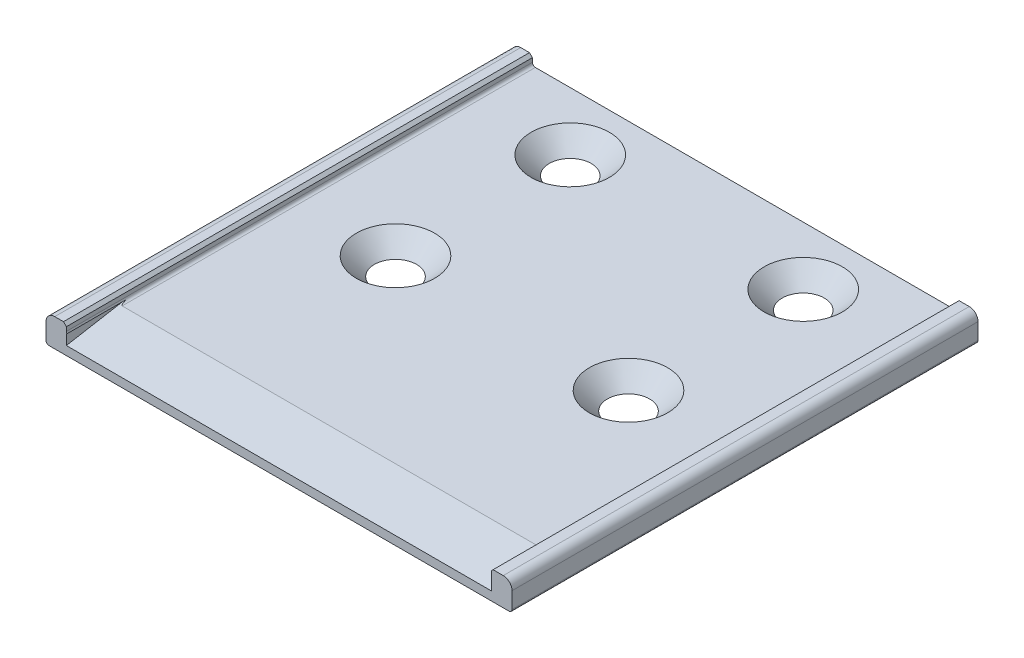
ISO-10303-21;
HEADER;
FILE_DESCRIPTION(('STEP AP214'),'2;1');
FILE_NAME('part.step','',(''),(''),'','','');
FILE_SCHEMA(('AUTOMOTIVE_DESIGN { 1 0 10303 214 1 1 1 1 }'));
ENDSEC;
DATA;
#1=APPLICATION_CONTEXT('core data for automotive mechanical design processes');
#2=APPLICATION_PROTOCOL_DEFINITION('international standard','automotive_design',2000,#1);
#3=PRODUCT_CONTEXT('',#1,'mechanical');
#4=PRODUCT('Part','Part','',(#3));
#5=PRODUCT_RELATED_PRODUCT_CATEGORY('part','',(#4));
#6=PRODUCT_DEFINITION_FORMATION('','',#4);
#7=PRODUCT_DEFINITION_CONTEXT('part definition',#1,'design');
#8=PRODUCT_DEFINITION('design','',#6,#7);
#9=PRODUCT_DEFINITION_SHAPE('','',#8);
#10=(LENGTH_UNIT() NAMED_UNIT(*) SI_UNIT(.MILLI.,.METRE.));
#11=(NAMED_UNIT(*) PLANE_ANGLE_UNIT() SI_UNIT($,.RADIAN.));
#12=(NAMED_UNIT(*) SI_UNIT($,.STERADIAN.) SOLID_ANGLE_UNIT());
#13=UNCERTAINTY_MEASURE_WITH_UNIT(LENGTH_MEASURE(1.E-05),#10,'distance_accuracy_value','');
#14=(GEOMETRIC_REPRESENTATION_CONTEXT(3) GLOBAL_UNCERTAINTY_ASSIGNED_CONTEXT((#13)) GLOBAL_UNIT_ASSIGNED_CONTEXT((#10,
#11,#12)) REPRESENTATION_CONTEXT('',''));
#15=CARTESIAN_POINT('',(0.,0.,0.));
#16=DIRECTION('',(0.,0.,1.));
#17=DIRECTION('',(1.,0.,0.));
#18=AXIS2_PLACEMENT_3D('',#15,#16,#17);
#19=CARTESIAN_POINT('',(79.5,0.5,-80.));
#20=DIRECTION('',(0.,0.,1.));
#21=DIRECTION('',(1.,0.,0.));
#22=AXIS2_PLACEMENT_3D('',#19,#20,#21);
#23=CYLINDRICAL_SURFACE('',#22,0.5);
#24=CARTESIAN_POINT('',(79.5,0.5,0.));
#25=DIRECTION('',(0.,0.,1.));
#26=DIRECTION('',(1.,0.,0.));
#27=AXIS2_PLACEMENT_3D('',#24,#25,#26);
#28=CIRCLE('',#27,0.5);
#29=CARTESIAN_POINT('',(79.5,0.,0.));
#30=VERTEX_POINT('',#29);
#31=CARTESIAN_POINT('',(80.,0.5,0.));
#32=VERTEX_POINT('',#31);
#33=EDGE_CURVE('E195',#30,#32,#28,.T.);
#34=ORIENTED_EDGE('',*,*,#33,.F.);
#35=DIRECTION('',(0.,0.,1.));
#36=VECTOR('',#35,1.);
#37=CARTESIAN_POINT('',(79.5,0.,-80.));
#38=LINE('',#37,#36);
#39=CARTESIAN_POINT('',(79.5,0.,-80.));
#40=VERTEX_POINT('',#39);
#41=EDGE_CURVE('E65',#40,#30,#38,.T.);
#42=ORIENTED_EDGE('',*,*,#41,.F.);
#43=CARTESIAN_POINT('',(79.5,0.5,-80.));
#44=DIRECTION('',(0.,0.,1.));
#45=DIRECTION('',(1.,0.,0.));
#46=AXIS2_PLACEMENT_3D('',#43,#44,#45);
#47=CIRCLE('',#46,0.5);
#48=CARTESIAN_POINT('',(80.,0.5,-80.));
#49=VERTEX_POINT('',#48);
#50=EDGE_CURVE('E237',#40,#49,#47,.T.);
#51=ORIENTED_EDGE('',*,*,#50,.T.);
#52=DIRECTION('',(0.,0.,1.));
#53=VECTOR('',#52,1.);
#54=CARTESIAN_POINT('',(80.,0.5,-80.));
#55=LINE('',#54,#53);
#56=EDGE_CURVE('E122',#49,#32,#55,.T.);
#57=ORIENTED_EDGE('',*,*,#56,.T.);
#58=EDGE_LOOP('',(#34,#42,#51,#57));
#59=FACE_BOUND('',#58,.T.);
#60=ADVANCED_FACE('F41',(#59),#23,.T.);
#61=CARTESIAN_POINT('',(0.500000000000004,0.,-80.));
#62=DIRECTION('',(0.,-1.,0.));
#63=DIRECTION('',(0.,0.,-1.));
#64=AXIS2_PLACEMENT_3D('',#61,#62,#63);
#65=PLANE('',#64);
#66=CARTESIAN_POINT('',(20.,0.,-40.));
#67=DIRECTION('',(0.,-1.,0.));
#68=DIRECTION('',(0.,0.,-1.));
#69=AXIS2_PLACEMENT_3D('',#66,#67,#68);
#70=CIRCLE('',#69,3.61999999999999);
#71=CARTESIAN_POINT('',(20.,0.,-43.62));
#72=VERTEX_POINT('',#71);
#73=EDGE_CURVE('E326',#72,#72,#70,.T.);
#74=ORIENTED_EDGE('',*,*,#73,.F.);
#75=EDGE_LOOP('',(#74));
#76=FACE_BOUND('',#75,.T.);
#77=CARTESIAN_POINT('',(20.,0.,-70.));
#78=DIRECTION('',(0.,-1.,0.));
#79=DIRECTION('',(0.,0.,-1.));
#80=AXIS2_PLACEMENT_3D('',#77,#78,#79);
#81=CIRCLE('',#80,3.61999999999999);
#82=CARTESIAN_POINT('',(20.,0.,-73.62));
#83=VERTEX_POINT('',#82);
#84=EDGE_CURVE('E332',#83,#83,#81,.T.);
#85=ORIENTED_EDGE('',*,*,#84,.F.);
#86=EDGE_LOOP('',(#85));
#87=FACE_BOUND('',#86,.T.);
#88=CARTESIAN_POINT('',(60.,0.,-40.));
#89=DIRECTION('',(0.,-1.,0.));
#90=DIRECTION('',(0.,0.,-1.));
#91=AXIS2_PLACEMENT_3D('',#88,#89,#90);
#92=CIRCLE('',#91,3.61999999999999);
#93=CARTESIAN_POINT('',(60.,0.,-43.62));
#94=VERTEX_POINT('',#93);
#95=EDGE_CURVE('E338',#94,#94,#92,.T.);
#96=ORIENTED_EDGE('',*,*,#95,.F.);
#97=EDGE_LOOP('',(#96));
#98=FACE_BOUND('',#97,.T.);
#99=CARTESIAN_POINT('',(60.,0.,-70.));
#100=DIRECTION('',(0.,-1.,0.));
#101=DIRECTION('',(0.,0.,-1.));
#102=AXIS2_PLACEMENT_3D('',#99,#100,#101);
#103=CIRCLE('',#102,3.61999999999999);
#104=CARTESIAN_POINT('',(60.,0.,-73.62));
#105=VERTEX_POINT('',#104);
#106=EDGE_CURVE('E199',#105,#105,#103,.T.);
#107=ORIENTED_EDGE('',*,*,#106,.F.);
#108=EDGE_LOOP('',(#107));
#109=FACE_BOUND('',#108,.T.);
#110=DIRECTION('',(1.,0.,0.));
#111=VECTOR('',#110,1.);
#112=CARTESIAN_POINT('',(0.500000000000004,0.,0.));
#113=LINE('',#112,#111);
#114=CARTESIAN_POINT('',(0.500000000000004,0.,0.));
#115=VERTEX_POINT('',#114);
#116=EDGE_CURVE('E234',#115,#30,#113,.T.);
#117=ORIENTED_EDGE('',*,*,#116,.F.);
#118=DIRECTION('',(0.,0.,1.));
#119=VECTOR('',#118,1.);
#120=CARTESIAN_POINT('',(0.500000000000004,0.,-80.));
#121=LINE('',#120,#119);
#122=CARTESIAN_POINT('',(0.500000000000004,0.,-80.));
#123=VERTEX_POINT('',#122);
#124=EDGE_CURVE('E176',#123,#115,#121,.T.);
#125=ORIENTED_EDGE('',*,*,#124,.F.);
#126=DIRECTION('',(1.,0.,0.));
#127=VECTOR('',#126,1.);
#128=CARTESIAN_POINT('',(0.500000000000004,0.,-80.));
#129=LINE('',#128,#127);
#130=EDGE_CURVE('E185',#123,#40,#129,.T.);
#131=ORIENTED_EDGE('',*,*,#130,.T.);
#132=ORIENTED_EDGE('',*,*,#41,.T.);
#133=EDGE_LOOP('',(#117,#125,#131,#132));
#134=FACE_BOUND('',#133,.T.);
#135=ADVANCED_FACE('F427',(#76,#87,#98,#109,#134),#65,.T.);
#136=CARTESIAN_POINT('',(0.5,0.5,-80.));
#137=DIRECTION('',(0.,0.,1.));
#138=DIRECTION('',(1.,0.,0.));
#139=AXIS2_PLACEMENT_3D('',#136,#137,#138);
#140=CYLINDRICAL_SURFACE('',#139,0.5);
#141=CARTESIAN_POINT('',(0.5,0.5,0.));
#142=DIRECTION('',(0.,0.,1.));
#143=DIRECTION('',(1.,0.,0.));
#144=AXIS2_PLACEMENT_3D('',#141,#142,#143);
#145=CIRCLE('',#144,0.5);
#146=CARTESIAN_POINT('',(0.,0.500000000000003,0.));
#147=VERTEX_POINT('',#146);
#148=EDGE_CURVE('E171',#147,#115,#145,.T.);
#149=ORIENTED_EDGE('',*,*,#148,.F.);
#150=DIRECTION('',(0.,0.,1.));
#151=VECTOR('',#150,1.);
#152=CARTESIAN_POINT('',(0.,0.500000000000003,-80.));
#153=LINE('',#152,#151);
#154=CARTESIAN_POINT('',(0.,0.500000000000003,-80.));
#155=VERTEX_POINT('',#154);
#156=EDGE_CURVE('E165',#155,#147,#153,.T.);
#157=ORIENTED_EDGE('',*,*,#156,.F.);
#158=CARTESIAN_POINT('',(0.5,0.5,-80.));
#159=DIRECTION('',(0.,0.,1.));
#160=DIRECTION('',(1.,0.,0.));
#161=AXIS2_PLACEMENT_3D('',#158,#159,#160);
#162=CIRCLE('',#161,0.5);
#163=EDGE_CURVE('E168',#155,#123,#162,.T.);
#164=ORIENTED_EDGE('',*,*,#163,.T.);
#165=ORIENTED_EDGE('',*,*,#124,.T.);
#166=EDGE_LOOP('',(#149,#157,#164,#165));
#167=FACE_BOUND('',#166,.T.);
#168=ADVANCED_FACE('F167',(#167),#140,.T.);
#169=CARTESIAN_POINT('',(0.,0.500000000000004,-80.));
#170=DIRECTION('',(-1.,0.,0.));
#171=DIRECTION('',(0.,0.,1.));
#172=AXIS2_PLACEMENT_3D('',#169,#170,#171);
#173=PLANE('',#172);
#174=DIRECTION('',(0.,-1.,0.));
#175=VECTOR('',#174,1.);
#176=CARTESIAN_POINT('',(0.,0.500000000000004,0.));
#177=LINE('',#176,#175);
#178=CARTESIAN_POINT('',(0.,3.3,0.));
#179=VERTEX_POINT('',#178);
#180=EDGE_CURVE('E231',#179,#147,#177,.T.);
#181=ORIENTED_EDGE('',*,*,#180,.F.);
#182=DIRECTION('',(0.,0.,1.));
#183=VECTOR('',#182,1.);
#184=CARTESIAN_POINT('',(0.,3.3,-80.));
#185=LINE('',#184,#183);
#186=CARTESIAN_POINT('',(0.,3.3,-80.));
#187=VERTEX_POINT('',#186);
#188=EDGE_CURVE('E177',#187,#179,#185,.T.);
#189=ORIENTED_EDGE('',*,*,#188,.F.);
#190=DIRECTION('',(0.,-1.,0.));
#191=VECTOR('',#190,1.);
#192=CARTESIAN_POINT('',(0.,0.500000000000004,-80.));
#193=LINE('',#192,#191);
#194=EDGE_CURVE('E183',#187,#155,#193,.T.);
#195=ORIENTED_EDGE('',*,*,#194,.T.);
#196=ORIENTED_EDGE('',*,*,#156,.T.);
#197=EDGE_LOOP('',(#181,#189,#195,#196));
#198=FACE_BOUND('',#197,.T.);
#199=ADVANCED_FACE('F187',(#198),#173,.T.);
#200=CARTESIAN_POINT('',(1.5,3.3,-80.));
#201=DIRECTION('',(0.,0.,1.));
#202=DIRECTION('',(1.,0.,0.));
#203=AXIS2_PLACEMENT_3D('',#200,#201,#202);
#204=CYLINDRICAL_SURFACE('',#203,1.5);
#205=CARTESIAN_POINT('',(1.5,3.3,0.));
#206=DIRECTION('',(0.,0.,1.));
#207=DIRECTION('',(-1.,0.,0.));
#208=AXIS2_PLACEMENT_3D('',#205,#206,#207);
#209=CIRCLE('',#208,1.5);
#210=CARTESIAN_POINT('',(1.5,4.8,0.));
#211=VERTEX_POINT('',#210);
#212=EDGE_CURVE('E228',#211,#179,#209,.T.);
#213=ORIENTED_EDGE('',*,*,#212,.F.);
#214=DIRECTION('',(0.,0.,1.));
#215=VECTOR('',#214,1.);
#216=CARTESIAN_POINT('',(1.5,4.8,-80.));
#217=LINE('',#216,#215);
#218=CARTESIAN_POINT('',(1.5,4.8,-80.));
#219=VERTEX_POINT('',#218);
#220=EDGE_CURVE('E242',#219,#211,#217,.T.);
#221=ORIENTED_EDGE('',*,*,#220,.F.);
#222=CARTESIAN_POINT('',(1.5,3.3,-80.));
#223=DIRECTION('',(0.,0.,1.));
#224=DIRECTION('',(-1.,0.,0.));
#225=AXIS2_PLACEMENT_3D('',#222,#223,#224);
#226=CIRCLE('',#225,1.5);
#227=EDGE_CURVE('E188',#219,#187,#226,.T.);
#228=ORIENTED_EDGE('',*,*,#227,.T.);
#229=ORIENTED_EDGE('',*,*,#188,.T.);
#230=EDGE_LOOP('',(#213,#221,#228,#229));
#231=FACE_BOUND('',#230,.T.);
#232=ADVANCED_FACE('F435',(#231),#204,.T.);
#233=CARTESIAN_POINT('',(1.5,4.8,-80.));
#234=DIRECTION('',(0.,1.,0.));
#235=DIRECTION('',(-1.,0.,0.));
#236=AXIS2_PLACEMENT_3D('',#233,#234,#235);
#237=PLANE('',#236);
#238=DIRECTION('',(-1.,0.,0.));
#239=VECTOR('',#238,1.);
#240=CARTESIAN_POINT('',(1.5,4.8,0.));
#241=LINE('',#240,#239);
#242=CARTESIAN_POINT('',(3.,4.8,0.));
#243=VERTEX_POINT('',#242);
#244=EDGE_CURVE('E225',#243,#211,#241,.T.);
#245=ORIENTED_EDGE('',*,*,#244,.F.);
#246=DIRECTION('',(0.,0.,1.));
#247=VECTOR('',#246,1.);
#248=CARTESIAN_POINT('',(3.,4.8,-80.));
#249=LINE('',#248,#247);
#250=CARTESIAN_POINT('',(3.,4.8,-80.));
#251=VERTEX_POINT('',#250);
#252=EDGE_CURVE('E244',#251,#243,#249,.T.);
#253=ORIENTED_EDGE('',*,*,#252,.F.);
#254=DIRECTION('',(-1.,0.,0.));
#255=VECTOR('',#254,1.);
#256=CARTESIAN_POINT('',(1.5,4.8,-80.));
#257=LINE('',#256,#255);
#258=EDGE_CURVE('E190',#251,#219,#257,.T.);
#259=ORIENTED_EDGE('',*,*,#258,.T.);
#260=ORIENTED_EDGE('',*,*,#220,.T.);
#261=EDGE_LOOP('',(#245,#253,#259,#260));
#262=FACE_BOUND('',#261,.T.);
#263=ADVANCED_FACE('F379',(#262),#237,.T.);
#264=CARTESIAN_POINT('',(3.,4.8,-80.));
#265=DIRECTION('',(0.707106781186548,0.707106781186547,0.));
#266=DIRECTION('',(-0.707106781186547,0.707106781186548,0.));
#267=AXIS2_PLACEMENT_3D('',#264,#265,#266);
#268=PLANE('',#267);
#269=DIRECTION('',(-0.707106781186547,0.707106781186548,0.));
#270=VECTOR('',#269,1.);
#271=CARTESIAN_POINT('',(3.,4.8,0.));
#272=LINE('',#271,#270);
#273=CARTESIAN_POINT('',(3.5,4.3,0.));
#274=VERTEX_POINT('',#273);
#275=EDGE_CURVE('E222',#274,#243,#272,.T.);
#276=ORIENTED_EDGE('',*,*,#275,.F.);
#277=DIRECTION('',(0.,0.,1.));
#278=VECTOR('',#277,1.);
#279=CARTESIAN_POINT('',(3.5,4.3,-80.));
#280=LINE('',#279,#278);
#281=CARTESIAN_POINT('',(3.5,4.3,-80.));
#282=VERTEX_POINT('',#281);
#283=EDGE_CURVE('E246',#282,#274,#280,.T.);
#284=ORIENTED_EDGE('',*,*,#283,.F.);
#285=DIRECTION('',(-0.707106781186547,0.707106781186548,0.));
#286=VECTOR('',#285,1.);
#287=CARTESIAN_POINT('',(3.,4.8,-80.));
#288=LINE('',#287,#286);
#289=EDGE_CURVE('E373',#282,#251,#288,.T.);
#290=ORIENTED_EDGE('',*,*,#289,.T.);
#291=ORIENTED_EDGE('',*,*,#252,.T.);
#292=EDGE_LOOP('',(#276,#284,#290,#291));
#293=FACE_BOUND('',#292,.T.);
#294=ADVANCED_FACE('F385',(#293),#268,.T.);
#295=CARTESIAN_POINT('',(3.5,4.3,-80.));
#296=DIRECTION('',(1.,0.,0.));
#297=DIRECTION('',(0.,1.,0.));
#298=AXIS2_PLACEMENT_3D('',#295,#296,#297);
#299=PLANE('',#298);
#300=DIRECTION('',(0.,1.,0.));
#301=VECTOR('',#300,1.);
#302=CARTESIAN_POINT('',(3.5,4.3,0.));
#303=LINE('',#302,#301);
#304=CARTESIAN_POINT('',(3.5,3.6,0.));
#305=VERTEX_POINT('',#304);
#306=EDGE_CURVE('E219',#305,#274,#303,.T.);
#307=ORIENTED_EDGE('',*,*,#306,.F.);
#308=DIRECTION('',(0.,0.,1.));
#309=VECTOR('',#308,1.);
#310=CARTESIAN_POINT('',(3.5,3.6,-80.));
#311=LINE('',#310,#309);
#312=CARTESIAN_POINT('',(3.5,3.6,-80.));
#313=VERTEX_POINT('',#312);
#314=EDGE_CURVE('E248',#313,#305,#311,.T.);
#315=ORIENTED_EDGE('',*,*,#314,.F.);
#316=DIRECTION('',(0.,1.,0.));
#317=VECTOR('',#316,1.);
#318=CARTESIAN_POINT('',(3.5,4.3,-80.));
#319=LINE('',#318,#317);
#320=EDGE_CURVE('E370',#313,#282,#319,.T.);
#321=ORIENTED_EDGE('',*,*,#320,.T.);
#322=ORIENTED_EDGE('',*,*,#283,.T.);
#323=EDGE_LOOP('',(#307,#315,#321,#322));
#324=FACE_BOUND('',#323,.T.);
#325=ADVANCED_FACE('F388',(#324),#299,.T.);
#326=CARTESIAN_POINT('',(4.,3.6,-80.));
#327=DIRECTION('',(0.,0.,1.));
#328=DIRECTION('',(1.,0.,0.));
#329=AXIS2_PLACEMENT_3D('',#326,#327,#328);
#330=CYLINDRICAL_SURFACE('',#329,0.5);
#331=DIRECTION('',(0.,0.,1.));
#332=VECTOR('',#331,1.);
#333=CARTESIAN_POINT('',(3.6,3.3,-80.));
#334=LINE('',#333,#332);
#335=CARTESIAN_POINT('',(3.60000000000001,3.29999999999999,-10.2083072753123));
#336=VERTEX_POINT('',#335);
#337=CARTESIAN_POINT('',(3.60000000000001,3.29999999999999,0.));
#338=VERTEX_POINT('',#337);
#339=EDGE_CURVE('E318',#336,#338,#334,.T.);
#340=ORIENTED_EDGE('',*,*,#339,.F.);
#341=CARTESIAN_POINT('',(4.,3.6,-11.9096918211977));
#342=DIRECTION('',(0.,-0.984807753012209,-0.173648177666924));
#343=DIRECTION('',(0.,-0.173648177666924,0.984807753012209));
#344=AXIS2_PLACEMENT_3D('',#341,#342,#343);
#345=ELLIPSE('',#344,2.87938524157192,0.5);
#346=CARTESIAN_POINT('',(4.,3.1,-9.07405091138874));
#347=VERTEX_POINT('',#346);
#348=EDGE_CURVE('E316',#347,#336,#345,.T.);
#349=ORIENTED_EDGE('',*,*,#348,.F.);
#350=DIRECTION('',(0.,0.,1.));
#351=VECTOR('',#350,1.);
#352=CARTESIAN_POINT('',(4.,3.1,-80.));
#353=LINE('',#352,#351);
#354=CARTESIAN_POINT('',(4.,3.1,-80.));
#355=VERTEX_POINT('',#354);
#356=EDGE_CURVE('E251',#355,#347,#353,.T.);
#357=ORIENTED_EDGE('',*,*,#356,.F.);
#358=CARTESIAN_POINT('',(4.,3.6,-80.));
#359=DIRECTION('',(0.,0.,-1.));
#360=DIRECTION('',(1.,0.,0.));
#361=AXIS2_PLACEMENT_3D('',#358,#359,#360);
#362=CIRCLE('',#361,0.5);
#363=EDGE_CURVE('E367',#355,#313,#362,.T.);
#364=ORIENTED_EDGE('',*,*,#363,.T.);
#365=ORIENTED_EDGE('',*,*,#314,.T.);
#366=CARTESIAN_POINT('',(4.,3.6,0.));
#367=DIRECTION('',(0.,0.,-1.));
#368=DIRECTION('',(1.,0.,0.));
#369=AXIS2_PLACEMENT_3D('',#366,#367,#368);
#370=CIRCLE('',#369,0.5);
#371=EDGE_CURVE('E217',#338,#305,#370,.T.);
#372=ORIENTED_EDGE('',*,*,#371,.F.);
#373=EDGE_LOOP('',(#340,#349,#357,#364,#365,#372));
#374=FACE_BOUND('',#373,.T.);
#375=ADVANCED_FACE('F393',(#374),#330,.F.);
#376=CARTESIAN_POINT('',(4.,3.1,-80.));
#377=DIRECTION('',(0.,1.,0.));
#378=DIRECTION('',(0.,0.,1.));
#379=AXIS2_PLACEMENT_3D('',#376,#377,#378);
#380=PLANE('',#379);
#381=DIRECTION('',(-1.,0.,0.));
#382=VECTOR('',#381,1.);
#383=CARTESIAN_POINT('',(3.99999999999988,3.1,-9.07405091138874));
#384=LINE('',#383,#382);
#385=CARTESIAN_POINT('',(76.,3.1,-9.07405091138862));
#386=VERTEX_POINT('',#385);
#387=EDGE_CURVE('E313',#386,#347,#384,.T.);
#388=ORIENTED_EDGE('',*,*,#387,.F.);
#389=DIRECTION('',(0.,0.,1.));
#390=VECTOR('',#389,1.);
#391=CARTESIAN_POINT('',(76.,3.1,-80.));
#392=LINE('',#391,#390);
#393=CARTESIAN_POINT('',(76.,3.1,-80.));
#394=VERTEX_POINT('',#393);
#395=EDGE_CURVE('E254',#394,#386,#392,.T.);
#396=ORIENTED_EDGE('',*,*,#395,.F.);
#397=DIRECTION('',(-1.,0.,0.));
#398=VECTOR('',#397,1.);
#399=CARTESIAN_POINT('',(4.,3.1,-80.));
#400=LINE('',#399,#398);
#401=EDGE_CURVE('E364',#394,#355,#400,.T.);
#402=ORIENTED_EDGE('',*,*,#401,.T.);
#403=ORIENTED_EDGE('',*,*,#356,.T.);
#404=EDGE_LOOP('',(#388,#396,#402,#403));
#405=FACE_BOUND('',#404,.T.);
#406=CARTESIAN_POINT('',(20.,3.1,-40.));
#407=DIRECTION('',(0.,1.,0.));
#408=DIRECTION('',(0.,0.,1.));
#409=AXIS2_PLACEMENT_3D('',#406,#407,#408);
#410=CIRCLE('',#409,6.72);
#411=CARTESIAN_POINT('',(20.,3.1,-33.28));
#412=VERTEX_POINT('',#411);
#413=EDGE_CURVE('E323',#412,#412,#410,.T.);
#414=ORIENTED_EDGE('',*,*,#413,.F.);
#415=EDGE_LOOP('',(#414));
#416=FACE_BOUND('',#415,.T.);
#417=CARTESIAN_POINT('',(20.,3.1,-70.));
#418=DIRECTION('',(0.,1.,0.));
#419=DIRECTION('',(0.,0.,1.));
#420=AXIS2_PLACEMENT_3D('',#417,#418,#419);
#421=CIRCLE('',#420,6.72);
#422=CARTESIAN_POINT('',(20.,3.1,-63.28));
#423=VERTEX_POINT('',#422);
#424=EDGE_CURVE('E329',#423,#423,#421,.T.);
#425=ORIENTED_EDGE('',*,*,#424,.F.);
#426=EDGE_LOOP('',(#425));
#427=FACE_BOUND('',#426,.T.);
#428=CARTESIAN_POINT('',(60.,3.1,-40.));
#429=DIRECTION('',(0.,1.,0.));
#430=DIRECTION('',(0.,0.,1.));
#431=AXIS2_PLACEMENT_3D('',#428,#429,#430);
#432=CIRCLE('',#431,6.72);
#433=CARTESIAN_POINT('',(60.,3.1,-33.28));
#434=VERTEX_POINT('',#433);
#435=EDGE_CURVE('E335',#434,#434,#432,.T.);
#436=ORIENTED_EDGE('',*,*,#435,.F.);
#437=EDGE_LOOP('',(#436));
#438=FACE_BOUND('',#437,.T.);
#439=CARTESIAN_POINT('',(60.,3.1,-70.));
#440=DIRECTION('',(0.,1.,0.));
#441=DIRECTION('',(0.,0.,1.));
#442=AXIS2_PLACEMENT_3D('',#439,#440,#441);
#443=CIRCLE('',#442,6.72);
#444=CARTESIAN_POINT('',(60.,3.1,-63.28));
#445=VERTEX_POINT('',#444);
#446=EDGE_CURVE('E341',#445,#445,#443,.T.);
#447=ORIENTED_EDGE('',*,*,#446,.F.);
#448=EDGE_LOOP('',(#447));
#449=FACE_BOUND('',#448,.T.);
#450=ADVANCED_FACE('F399',(#405,#416,#427,#438,#449),#380,.T.);
#451=CARTESIAN_POINT('',(76.,3.6,-80.));
#452=DIRECTION('',(0.,0.,1.));
#453=DIRECTION('',(1.,0.,0.));
#454=AXIS2_PLACEMENT_3D('',#451,#452,#453);
#455=CYLINDRICAL_SURFACE('',#454,0.5);
#456=DIRECTION('',(0.,0.,1.));
#457=VECTOR('',#456,1.);
#458=CARTESIAN_POINT('',(76.4,3.30000000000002,-80.));
#459=LINE('',#458,#457);
#460=CARTESIAN_POINT('',(76.4,3.30000000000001,0.));
#461=VERTEX_POINT('',#460);
#462=CARTESIAN_POINT('',(76.4,3.30000000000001,-10.2083072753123));
#463=VERTEX_POINT('',#462);
#464=EDGE_CURVE('E321',#461,#463,#459,.F.);
#465=ORIENTED_EDGE('',*,*,#464,.F.);
#466=CARTESIAN_POINT('',(76.,3.6,0.));
#467=DIRECTION('',(0.,0.,-1.));
#468=DIRECTION('',(-1.,0.,0.));
#469=AXIS2_PLACEMENT_3D('',#466,#467,#468);
#470=CIRCLE('',#469,0.5);
#471=CARTESIAN_POINT('',(76.5,3.6,0.));
#472=VERTEX_POINT('',#471);
#473=EDGE_CURVE('E214',#472,#461,#470,.T.);
#474=ORIENTED_EDGE('',*,*,#473,.F.);
#475=DIRECTION('',(0.,0.,1.));
#476=VECTOR('',#475,1.);
#477=CARTESIAN_POINT('',(76.5,3.6,-80.));
#478=LINE('',#477,#476);
#479=CARTESIAN_POINT('',(76.5,3.6,-80.));
#480=VERTEX_POINT('',#479);
#481=EDGE_CURVE('E257',#480,#472,#478,.T.);
#482=ORIENTED_EDGE('',*,*,#481,.F.);
#483=CARTESIAN_POINT('',(76.,3.6,-80.));
#484=DIRECTION('',(0.,0.,-1.));
#485=DIRECTION('',(-1.,0.,0.));
#486=AXIS2_PLACEMENT_3D('',#483,#484,#485);
#487=CIRCLE('',#486,0.5);
#488=EDGE_CURVE('E361',#480,#394,#487,.T.);
#489=ORIENTED_EDGE('',*,*,#488,.T.);
#490=ORIENTED_EDGE('',*,*,#395,.T.);
#491=CARTESIAN_POINT('',(76.,3.6,-11.9096918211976));
#492=DIRECTION('',(0.,-0.984807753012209,-0.173648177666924));
#493=DIRECTION('',(0.,-0.173648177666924,0.984807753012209));
#494=AXIS2_PLACEMENT_3D('',#491,#492,#493);
#495=ELLIPSE('',#494,2.87938524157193,0.5);
#496=EDGE_CURVE('E310',#463,#386,#495,.T.);
#497=ORIENTED_EDGE('',*,*,#496,.F.);
#498=EDGE_LOOP('',(#465,#474,#482,#489,#490,#497));
#499=FACE_BOUND('',#498,.T.);
#500=ADVANCED_FACE('F454',(#499),#455,.F.);
#501=CARTESIAN_POINT('',(76.5,4.55,-80.));
#502=DIRECTION('',(-1.,0.,0.));
#503=DIRECTION('',(0.,0.,1.));
#504=AXIS2_PLACEMENT_3D('',#501,#502,#503);
#505=PLANE('',#504);
#506=DIRECTION('',(0.,-1.,0.));
#507=VECTOR('',#506,1.);
#508=CARTESIAN_POINT('',(76.5,4.55,0.));
#509=LINE('',#508,#507);
#510=CARTESIAN_POINT('',(76.5,4.55,0.));
#511=VERTEX_POINT('',#510);
#512=EDGE_CURVE('E211',#511,#472,#509,.T.);
#513=ORIENTED_EDGE('',*,*,#512,.F.);
#514=DIRECTION('',(0.,0.,1.));
#515=VECTOR('',#514,1.);
#516=CARTESIAN_POINT('',(76.5,4.55,-80.));
#517=LINE('',#516,#515);
#518=CARTESIAN_POINT('',(76.5,4.55,-80.));
#519=VERTEX_POINT('',#518);
#520=EDGE_CURVE('E259',#519,#511,#517,.T.);
#521=ORIENTED_EDGE('',*,*,#520,.F.);
#522=DIRECTION('',(0.,-1.,0.));
#523=VECTOR('',#522,1.);
#524=CARTESIAN_POINT('',(76.5,4.55,-80.));
#525=LINE('',#524,#523);
#526=EDGE_CURVE('E358',#519,#480,#525,.T.);
#527=ORIENTED_EDGE('',*,*,#526,.T.);
#528=ORIENTED_EDGE('',*,*,#481,.T.);
#529=EDGE_LOOP('',(#513,#521,#527,#528));
#530=FACE_BOUND('',#529,.T.);
#531=ADVANCED_FACE('F457',(#530),#505,.T.);
#532=CARTESIAN_POINT('',(76.75,4.8,-80.));
#533=DIRECTION('',(-0.707106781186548,0.707106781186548,0.));
#534=DIRECTION('',(-0.707106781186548,-0.707106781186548,0.));
#535=AXIS2_PLACEMENT_3D('',#532,#533,#534);
#536=PLANE('',#535);
#537=DIRECTION('',(-0.707106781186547,-0.707106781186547,0.));
#538=VECTOR('',#537,1.);
#539=CARTESIAN_POINT('',(76.75,4.8,0.));
#540=LINE('',#539,#538);
#541=CARTESIAN_POINT('',(76.75,4.8,0.));
#542=VERTEX_POINT('',#541);
#543=EDGE_CURVE('E208',#542,#511,#540,.T.);
#544=ORIENTED_EDGE('',*,*,#543,.F.);
#545=DIRECTION('',(0.,0.,1.));
#546=VECTOR('',#545,1.);
#547=CARTESIAN_POINT('',(76.75,4.8,-80.));
#548=LINE('',#547,#546);
#549=CARTESIAN_POINT('',(76.75,4.8,-80.));
#550=VERTEX_POINT('',#549);
#551=EDGE_CURVE('E261',#550,#542,#548,.T.);
#552=ORIENTED_EDGE('',*,*,#551,.F.);
#553=DIRECTION('',(-0.707106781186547,-0.707106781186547,0.));
#554=VECTOR('',#553,1.);
#555=CARTESIAN_POINT('',(76.75,4.8,-80.));
#556=LINE('',#555,#554);
#557=EDGE_CURVE('E355',#550,#519,#556,.T.);
#558=ORIENTED_EDGE('',*,*,#557,.T.);
#559=ORIENTED_EDGE('',*,*,#520,.T.);
#560=EDGE_LOOP('',(#544,#552,#558,#559));
#561=FACE_BOUND('',#560,.T.);
#562=ADVANCED_FACE('F461',(#561),#536,.T.);
#563=CARTESIAN_POINT('',(76.75,4.8,-80.));
#564=DIRECTION('',(0.,1.,0.));
#565=DIRECTION('',(0.,0.,1.));
#566=AXIS2_PLACEMENT_3D('',#563,#564,#565);
#567=PLANE('',#566);
#568=DIRECTION('',(-1.,0.,0.));
#569=VECTOR('',#568,1.);
#570=CARTESIAN_POINT('',(76.75,4.8,0.));
#571=LINE('',#570,#569);
#572=CARTESIAN_POINT('',(78.5,4.8,0.));
#573=VERTEX_POINT('',#572);
#574=EDGE_CURVE('E205',#573,#542,#571,.T.);
#575=ORIENTED_EDGE('',*,*,#574,.F.);
#576=DIRECTION('',(0.,0.,1.));
#577=VECTOR('',#576,1.);
#578=CARTESIAN_POINT('',(78.5,4.8,-80.));
#579=LINE('',#578,#577);
#580=CARTESIAN_POINT('',(78.5,4.8,-80.));
#581=VERTEX_POINT('',#580);
#582=EDGE_CURVE('E263',#581,#573,#579,.T.);
#583=ORIENTED_EDGE('',*,*,#582,.F.);
#584=DIRECTION('',(-1.,0.,0.));
#585=VECTOR('',#584,1.);
#586=CARTESIAN_POINT('',(76.75,4.8,-80.));
#587=LINE('',#586,#585);
#588=EDGE_CURVE('E352',#581,#550,#587,.T.);
#589=ORIENTED_EDGE('',*,*,#588,.T.);
#590=ORIENTED_EDGE('',*,*,#551,.T.);
#591=EDGE_LOOP('',(#575,#583,#589,#590));
#592=FACE_BOUND('',#591,.T.);
#593=ADVANCED_FACE('F465',(#592),#567,.T.);
#594=CARTESIAN_POINT('',(78.5,3.3,-80.));
#595=DIRECTION('',(0.,0.,1.));
#596=DIRECTION('',(1.,0.,0.));
#597=AXIS2_PLACEMENT_3D('',#594,#595,#596);
#598=CYLINDRICAL_SURFACE('',#597,1.5);
#599=CARTESIAN_POINT('',(78.5,3.3,0.));
#600=DIRECTION('',(0.,0.,1.));
#601=DIRECTION('',(-1.,0.,0.));
#602=AXIS2_PLACEMENT_3D('',#599,#600,#601);
#603=CIRCLE('',#602,1.5);
#604=CARTESIAN_POINT('',(80.,3.3,0.));
#605=VERTEX_POINT('',#604);
#606=EDGE_CURVE('E202',#605,#573,#603,.T.);
#607=ORIENTED_EDGE('',*,*,#606,.F.);
#608=DIRECTION('',(0.,0.,1.));
#609=VECTOR('',#608,1.);
#610=CARTESIAN_POINT('',(80.,3.3,-80.));
#611=LINE('',#610,#609);
#612=CARTESIAN_POINT('',(80.,3.3,-80.));
#613=VERTEX_POINT('',#612);
#614=EDGE_CURVE('E265',#613,#605,#611,.T.);
#615=ORIENTED_EDGE('',*,*,#614,.F.);
#616=CARTESIAN_POINT('',(78.5,3.3,-80.));
#617=DIRECTION('',(0.,0.,1.));
#618=DIRECTION('',(-1.,0.,0.));
#619=AXIS2_PLACEMENT_3D('',#616,#617,#618);
#620=CIRCLE('',#619,1.5);
#621=EDGE_CURVE('E349',#613,#581,#620,.T.);
#622=ORIENTED_EDGE('',*,*,#621,.T.);
#623=ORIENTED_EDGE('',*,*,#582,.T.);
#624=EDGE_LOOP('',(#607,#615,#622,#623));
#625=FACE_BOUND('',#624,.T.);
#626=ADVANCED_FACE('F469',(#625),#598,.T.);
#627=CARTESIAN_POINT('',(80.,0.5,-80.));
#628=DIRECTION('',(1.,0.,0.));
#629=DIRECTION('',(0.,0.,-1.));
#630=AXIS2_PLACEMENT_3D('',#627,#628,#629);
#631=PLANE('',#630);
#632=DIRECTION('',(0.,1.,0.));
#633=VECTOR('',#632,1.);
#634=CARTESIAN_POINT('',(80.,0.5,0.));
#635=LINE('',#634,#633);
#636=EDGE_CURVE('E198',#32,#605,#635,.T.);
#637=ORIENTED_EDGE('',*,*,#636,.F.);
#638=ORIENTED_EDGE('',*,*,#56,.F.);
#639=DIRECTION('',(0.,1.,0.));
#640=VECTOR('',#639,1.);
#641=CARTESIAN_POINT('',(80.,0.5,-80.));
#642=LINE('',#641,#640);
#643=EDGE_CURVE('E347',#49,#613,#642,.T.);
#644=ORIENTED_EDGE('',*,*,#643,.T.);
#645=ORIENTED_EDGE('',*,*,#614,.T.);
#646=EDGE_LOOP('',(#637,#638,#644,#645));
#647=FACE_BOUND('',#646,.T.);
#648=ADVANCED_FACE('F472',(#647),#631,.T.);
#649=CARTESIAN_POINT('',(79.5,0.5,-80.));
#650=DIRECTION('',(0.,0.,1.));
#651=DIRECTION('',(1.,0.,0.));
#652=AXIS2_PLACEMENT_3D('',#649,#650,#651);
#653=PLANE('',#652);
#654=ORIENTED_EDGE('',*,*,#50,.F.);
#655=ORIENTED_EDGE('',*,*,#130,.F.);
#656=ORIENTED_EDGE('',*,*,#163,.F.);
#657=ORIENTED_EDGE('',*,*,#194,.F.);
#658=ORIENTED_EDGE('',*,*,#227,.F.);
#659=ORIENTED_EDGE('',*,*,#258,.F.);
#660=ORIENTED_EDGE('',*,*,#289,.F.);
#661=ORIENTED_EDGE('',*,*,#320,.F.);
#662=ORIENTED_EDGE('',*,*,#363,.F.);
#663=ORIENTED_EDGE('',*,*,#401,.F.);
#664=ORIENTED_EDGE('',*,*,#488,.F.);
#665=ORIENTED_EDGE('',*,*,#526,.F.);
#666=ORIENTED_EDGE('',*,*,#557,.F.);
#667=ORIENTED_EDGE('',*,*,#588,.F.);
#668=ORIENTED_EDGE('',*,*,#621,.F.);
#669=ORIENTED_EDGE('',*,*,#643,.F.);
#670=EDGE_LOOP('',(#654,#655,#656,#657,#658,#659,#660,#661,#662,#663,#664,#665,#666,#667,#668,#669));
#671=FACE_BOUND('',#670,.T.);
#672=ADVANCED_FACE('F181',(#671),#653,.F.);
#673=CARTESIAN_POINT('',(79.5,0.5,0.));
#674=DIRECTION('',(0.,0.,1.));
#675=DIRECTION('',(1.,0.,0.));
#676=AXIS2_PLACEMENT_3D('',#673,#674,#675);
#677=PLANE('',#676);
#678=DIRECTION('',(-1.,0.,0.));
#679=VECTOR('',#678,1.);
#680=CARTESIAN_POINT('',(79.5,3.30000000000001,0.));
#681=LINE('',#680,#679);
#682=CARTESIAN_POINT('',(3.5,3.29999999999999,0.));
#683=VERTEX_POINT('',#682);
#684=EDGE_CURVE('E11',#338,#683,#681,.T.);
#685=ORIENTED_EDGE('',*,*,#684,.F.);
#686=ORIENTED_EDGE('',*,*,#371,.T.);
#687=ORIENTED_EDGE('',*,*,#306,.T.);
#688=ORIENTED_EDGE('',*,*,#275,.T.);
#689=ORIENTED_EDGE('',*,*,#244,.T.);
#690=ORIENTED_EDGE('',*,*,#212,.T.);
#691=ORIENTED_EDGE('',*,*,#180,.T.);
#692=ORIENTED_EDGE('',*,*,#148,.T.);
#693=ORIENTED_EDGE('',*,*,#116,.T.);
#694=ORIENTED_EDGE('',*,*,#33,.T.);
#695=ORIENTED_EDGE('',*,*,#636,.T.);
#696=ORIENTED_EDGE('',*,*,#606,.T.);
#697=ORIENTED_EDGE('',*,*,#574,.T.);
#698=ORIENTED_EDGE('',*,*,#543,.T.);
#699=ORIENTED_EDGE('',*,*,#512,.T.);
#700=ORIENTED_EDGE('',*,*,#473,.T.);
#701=CARTESIAN_POINT('',(76.5,3.30000000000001,0.));
#702=VERTEX_POINT('',#701);
#703=EDGE_CURVE('E49',#702,#461,#681,.T.);
#704=ORIENTED_EDGE('',*,*,#703,.F.);
#705=DIRECTION('',(0.,-1.,0.));
#706=VECTOR('',#705,1.);
#707=CARTESIAN_POINT('',(76.5,0.5,0.));
#708=LINE('',#707,#706);
#709=CARTESIAN_POINT('',(76.5,1.50000000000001,0.));
#710=VERTEX_POINT('',#709);
#711=EDGE_CURVE('E239',#702,#710,#708,.T.);
#712=ORIENTED_EDGE('',*,*,#711,.T.);
#713=DIRECTION('',(1.,0.,0.));
#714=VECTOR('',#713,1.);
#715=CARTESIAN_POINT('',(3.5,1.49999999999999,0.));
#716=LINE('',#715,#714);
#717=CARTESIAN_POINT('',(3.5,1.49999999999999,0.));
#718=VERTEX_POINT('',#717);
#719=EDGE_CURVE('E297',#718,#710,#716,.T.);
#720=ORIENTED_EDGE('',*,*,#719,.F.);
#721=DIRECTION('',(0.,-1.,0.));
#722=VECTOR('',#721,1.);
#723=CARTESIAN_POINT('',(3.5,0.5,0.));
#724=LINE('',#723,#722);
#725=EDGE_CURVE('E44',#683,#718,#724,.T.);
#726=ORIENTED_EDGE('',*,*,#725,.F.);
#727=EDGE_LOOP('',(#685,#686,#687,#688,#689,#690,#691,#692,#693,#694,#695,#696,#697,#698,#699,
#700,#704,#712,#720,#726));
#728=FACE_BOUND('',#727,.T.);
#729=ADVANCED_FACE('F302',(#728),#677,.T.);
#730=CARTESIAN_POINT('',(60.,3.1,-70.));
#731=DIRECTION('',(0.,1.,0.));
#732=DIRECTION('',(0.,0.,1.));
#733=AXIS2_PLACEMENT_3D('',#730,#731,#732);
#734=CONICAL_SURFACE('',#733,6.72,0.785398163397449);
#735=ORIENTED_EDGE('',*,*,#106,.T.);
#736=EDGE_LOOP('',(#735));
#737=FACE_BOUND('',#736,.T.);
#738=ORIENTED_EDGE('',*,*,#446,.T.);
#739=EDGE_LOOP('',(#738));
#740=FACE_BOUND('',#739,.T.);
#741=ADVANCED_FACE('F492',(#737,#740),#734,.F.);
#742=CARTESIAN_POINT('',(60.,3.1,-40.));
#743=DIRECTION('',(0.,1.,0.));
#744=DIRECTION('',(0.,0.,1.));
#745=AXIS2_PLACEMENT_3D('',#742,#743,#744);
#746=CONICAL_SURFACE('',#745,6.72,0.785398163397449);
#747=ORIENTED_EDGE('',*,*,#95,.T.);
#748=EDGE_LOOP('',(#747));
#749=FACE_BOUND('',#748,.T.);
#750=ORIENTED_EDGE('',*,*,#435,.T.);
#751=EDGE_LOOP('',(#750));
#752=FACE_BOUND('',#751,.T.);
#753=ADVANCED_FACE('F594',(#749,#752),#746,.F.);
#754=CARTESIAN_POINT('',(20.,3.1,-70.));
#755=DIRECTION('',(0.,1.,0.));
#756=DIRECTION('',(0.,0.,1.));
#757=AXIS2_PLACEMENT_3D('',#754,#755,#756);
#758=CONICAL_SURFACE('',#757,6.72,0.785398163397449);
#759=ORIENTED_EDGE('',*,*,#84,.T.);
#760=EDGE_LOOP('',(#759));
#761=FACE_BOUND('',#760,.T.);
#762=ORIENTED_EDGE('',*,*,#424,.T.);
#763=EDGE_LOOP('',(#762));
#764=FACE_BOUND('',#763,.T.);
#765=ADVANCED_FACE('F603',(#761,#764),#758,.F.);
#766=CARTESIAN_POINT('',(20.,3.1,-40.));
#767=DIRECTION('',(0.,1.,0.));
#768=DIRECTION('',(0.,0.,1.));
#769=AXIS2_PLACEMENT_3D('',#766,#767,#768);
#770=CONICAL_SURFACE('',#769,6.72,0.785398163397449);
#771=ORIENTED_EDGE('',*,*,#73,.T.);
#772=EDGE_LOOP('',(#771));
#773=FACE_BOUND('',#772,.T.);
#774=ORIENTED_EDGE('',*,*,#413,.T.);
#775=EDGE_LOOP('',(#774));
#776=FACE_BOUND('',#775,.T.);
#777=ADVANCED_FACE('F612',(#773,#776),#770,.F.);
#778=CARTESIAN_POINT('',(3.5,3.29999999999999,-10.2083072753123));
#779=DIRECTION('',(0.,1.,0.));
#780=DIRECTION('',(-1.,0.,0.));
#781=AXIS2_PLACEMENT_3D('',#778,#779,#780);
#782=PLANE('',#781);
#783=ORIENTED_EDGE('',*,*,#464,.T.);
#784=DIRECTION('',(1.,0.,0.));
#785=VECTOR('',#784,1.);
#786=CARTESIAN_POINT('',(3.5,3.29999999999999,-10.2083072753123));
#787=LINE('',#786,#785);
#788=CARTESIAN_POINT('',(76.5,3.30000000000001,-10.2083072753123));
#789=VERTEX_POINT('',#788);
#790=EDGE_CURVE('E303',#463,#789,#787,.T.);
#791=ORIENTED_EDGE('',*,*,#790,.T.);
#792=DIRECTION('',(0.,0.,1.));
#793=VECTOR('',#792,1.);
#794=CARTESIAN_POINT('',(76.5,3.30000000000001,-10.2083072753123));
#795=LINE('',#794,#793);
#796=EDGE_CURVE('E300',#789,#702,#795,.T.);
#797=ORIENTED_EDGE('',*,*,#796,.T.);
#798=ORIENTED_EDGE('',*,*,#703,.T.);
#799=EDGE_LOOP('',(#783,#791,#797,#798));
#800=FACE_BOUND('',#799,.T.);
#801=ADVANCED_FACE('F415',(#800),#782,.F.);
#802=ORIENTED_EDGE('',*,*,#339,.T.);
#803=ORIENTED_EDGE('',*,*,#684,.T.);
#804=DIRECTION('',(0.,0.,1.));
#805=VECTOR('',#804,1.);
#806=CARTESIAN_POINT('',(3.5,3.29999999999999,-10.2083072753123));
#807=LINE('',#806,#805);
#808=CARTESIAN_POINT('',(3.5,3.29999999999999,-10.2083072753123));
#809=VERTEX_POINT('',#808);
#810=EDGE_CURVE('E287',#809,#683,#807,.T.);
#811=ORIENTED_EDGE('',*,*,#810,.F.);
#812=EDGE_CURVE('E299',#809,#336,#787,.T.);
#813=ORIENTED_EDGE('',*,*,#812,.T.);
#814=EDGE_LOOP('',(#802,#803,#811,#813));
#815=FACE_BOUND('',#814,.T.);
#816=ADVANCED_FACE('F629',(#815),#782,.F.);
#817=CARTESIAN_POINT('',(3.5,1.49999999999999,0.));
#818=DIRECTION('',(0.,-0.984807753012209,-0.173648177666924));
#819=DIRECTION('',(0.,0.173648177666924,-0.984807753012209));
#820=AXIS2_PLACEMENT_3D('',#817,#818,#819);
#821=PLANE('',#820);
#822=ORIENTED_EDGE('',*,*,#348,.T.);
#823=ORIENTED_EDGE('',*,*,#812,.F.);
#824=DIRECTION('',(0.,0.173648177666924,-0.984807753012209));
#825=VECTOR('',#824,1.);
#826=CARTESIAN_POINT('',(3.5,1.49999999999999,0.));
#827=LINE('',#826,#825);
#828=EDGE_CURVE('E284',#718,#809,#827,.T.);
#829=ORIENTED_EDGE('',*,*,#828,.F.);
#830=ORIENTED_EDGE('',*,*,#719,.T.);
#831=DIRECTION('',(0.,0.173648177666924,-0.984807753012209));
#832=VECTOR('',#831,1.);
#833=CARTESIAN_POINT('',(76.5,1.50000000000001,0.));
#834=LINE('',#833,#832);
#835=EDGE_CURVE('E56',#710,#789,#834,.T.);
#836=ORIENTED_EDGE('',*,*,#835,.T.);
#837=ORIENTED_EDGE('',*,*,#790,.F.);
#838=ORIENTED_EDGE('',*,*,#496,.T.);
#839=ORIENTED_EDGE('',*,*,#387,.T.);
#840=EDGE_LOOP('',(#822,#823,#829,#830,#836,#837,#838,#839));
#841=FACE_BOUND('',#840,.T.);
#842=ADVANCED_FACE('F296',(#841),#821,.F.);
#843=CARTESIAN_POINT('',(3.5,0.,0.));
#844=DIRECTION('',(-1.,0.,0.));
#845=DIRECTION('',(0.,0.,1.));
#846=AXIS2_PLACEMENT_3D('',#843,#844,#845);
#847=PLANE('',#846);
#848=ORIENTED_EDGE('',*,*,#725,.T.);
#849=ORIENTED_EDGE('',*,*,#828,.T.);
#850=ORIENTED_EDGE('',*,*,#810,.T.);
#851=EDGE_LOOP('',(#848,#849,#850));
#852=FACE_BOUND('',#851,.T.);
#853=ADVANCED_FACE('F282',(#852),#847,.F.);
#854=CARTESIAN_POINT('',(76.5,0.,0.));
#855=DIRECTION('',(-1.,0.,0.));
#856=DIRECTION('',(0.,0.,1.));
#857=AXIS2_PLACEMENT_3D('',#854,#855,#856);
#858=PLANE('',#857);
#859=ORIENTED_EDGE('',*,*,#796,.F.);
#860=ORIENTED_EDGE('',*,*,#835,.F.);
#861=ORIENTED_EDGE('',*,*,#711,.F.);
#862=EDGE_LOOP('',(#859,#860,#861));
#863=FACE_BOUND('',#862,.T.);
#864=ADVANCED_FACE('F417',(#863),#858,.T.);
#865=CLOSED_SHELL('',(#60,#135,#168,#199,#232,#263,#294,#325,#375,#450,#500,#531,#562,#593,#626,
#648,#672,#729,#741,#753,#765,#777,#801,#816,#842,#853,#864));
#866=MANIFOLD_SOLID_BREP('B2',#865);
#867=ADVANCED_BREP_SHAPE_REPRESENTATION('',(#18,#866),#14);
#868=SHAPE_DEFINITION_REPRESENTATION(#9,#867);
ENDSEC;
END-ISO-10303-21;
